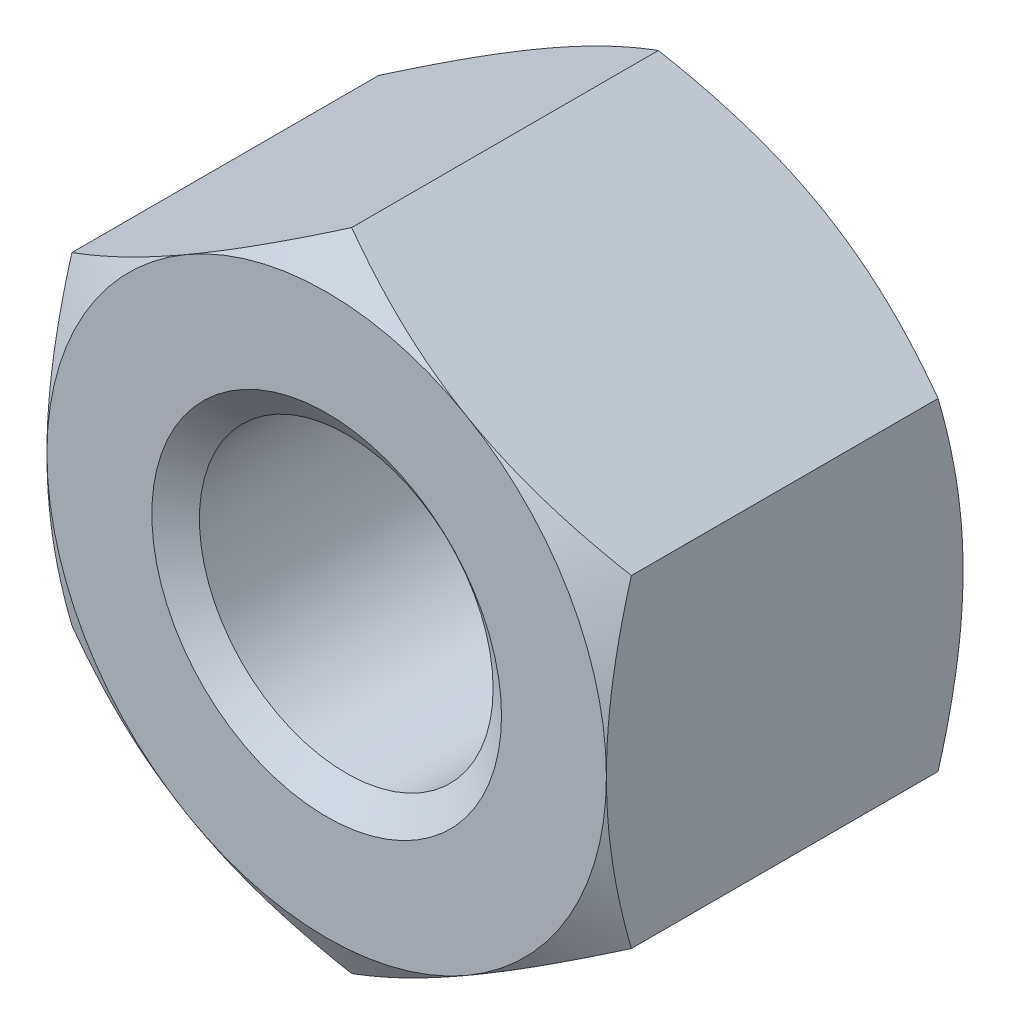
ISO-10303-21;
HEADER;
FILE_DESCRIPTION(('STEP AP214'),'2;1');
FILE_NAME('part.step','',(''),(''),'','','');
FILE_SCHEMA(('AUTOMOTIVE_DESIGN { 1 0 10303 214 1 1 1 1 }'));
ENDSEC;
DATA;
#1=APPLICATION_CONTEXT('core data for automotive mechanical design processes');
#2=APPLICATION_PROTOCOL_DEFINITION('international standard','automotive_design',2000,#1);
#3=PRODUCT_CONTEXT('',#1,'mechanical');
#4=PRODUCT('Part','Part','',(#3));
#5=PRODUCT_RELATED_PRODUCT_CATEGORY('part','',(#4));
#6=PRODUCT_DEFINITION_FORMATION('','',#4);
#7=PRODUCT_DEFINITION_CONTEXT('part definition',#1,'design');
#8=PRODUCT_DEFINITION('design','',#6,#7);
#9=PRODUCT_DEFINITION_SHAPE('','',#8);
#10=(LENGTH_UNIT() NAMED_UNIT(*) SI_UNIT(.MILLI.,.METRE.));
#11=(NAMED_UNIT(*) PLANE_ANGLE_UNIT() SI_UNIT($,.RADIAN.));
#12=(NAMED_UNIT(*) SI_UNIT($,.STERADIAN.) SOLID_ANGLE_UNIT());
#13=UNCERTAINTY_MEASURE_WITH_UNIT(LENGTH_MEASURE(1.E-05),#10,'distance_accuracy_value','');
#14=(GEOMETRIC_REPRESENTATION_CONTEXT(3) GLOBAL_UNCERTAINTY_ASSIGNED_CONTEXT((#13)) GLOBAL_UNIT_ASSIGNED_CONTEXT((#10,
#11,#12)) REPRESENTATION_CONTEXT('',''));
#15=CARTESIAN_POINT('',(0.,0.,0.));
#16=DIRECTION('',(0.,0.,1.));
#17=DIRECTION('',(1.,0.,0.));
#18=AXIS2_PLACEMENT_3D('',#15,#16,#17);
#19=CARTESIAN_POINT('',(0.,0.,-5.1));
#20=DIRECTION('',(0.,0.,1.));
#21=DIRECTION('',(1.,0.,0.));
#22=AXIS2_PLACEMENT_3D('',#19,#20,#21);
#23=CYLINDRICAL_SURFACE('',#22,2.1);
#24=CARTESIAN_POINT('',(0.,0.,-0.28008301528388));
#25=DIRECTION('',(0.,0.,1.));
#26=DIRECTION('',(1.,0.,0.));
#27=AXIS2_PLACEMENT_3D('',#24,#25,#26);
#28=CIRCLE('',#27,2.1);
#29=CARTESIAN_POINT('',(2.1,0.,-0.28008301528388));
#30=VERTEX_POINT('',#29);
#31=EDGE_CURVE('E166',#30,#30,#28,.F.);
#32=ORIENTED_EDGE('',*,*,#31,.F.);
#33=EDGE_LOOP('',(#32));
#34=FACE_BOUND('',#33,.T.);
#35=CARTESIAN_POINT('',(0.,0.,-4.79451698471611));
#36=DIRECTION('',(0.,0.,-1.));
#37=DIRECTION('',(-1.,0.,0.));
#38=AXIS2_PLACEMENT_3D('',#35,#36,#37);
#39=CIRCLE('',#38,2.1);
#40=CARTESIAN_POINT('',(-2.1,0.,-4.79451698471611));
#41=VERTEX_POINT('',#40);
#42=EDGE_CURVE('E31',#41,#41,#39,.F.);
#43=ORIENTED_EDGE('',*,*,#42,.F.);
#44=EDGE_LOOP('',(#43));
#45=FACE_BOUND('',#44,.T.);
#46=ADVANCED_FACE('F26',(#34,#45),#23,.F.);
#47=CARTESIAN_POINT('',(0.,4.61880215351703,-5.1));
#48=DIRECTION('',(0.,0.,-1.));
#49=DIRECTION('',(-1.,0.,0.));
#50=AXIS2_PLACEMENT_3D('',#47,#48,#49);
#51=PLANE('',#50);
#52=CARTESIAN_POINT('',(0.,0.,-5.1));
#53=DIRECTION('',(0.,0.,-1.));
#54=DIRECTION('',(-1.,0.,0.));
#55=AXIS2_PLACEMENT_3D('',#52,#53,#54);
#56=CIRCLE('',#55,4.00000000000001);
#57=CARTESIAN_POINT('',(-4.,0.,-5.1));
#58=VERTEX_POINT('',#57);
#59=CARTESIAN_POINT('',(-2.00000000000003,-3.46410161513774,-5.1));
#60=VERTEX_POINT('',#59);
#61=EDGE_CURVE('E162',#58,#60,#56,.F.);
#62=ORIENTED_EDGE('',*,*,#61,.F.);
#63=CARTESIAN_POINT('',(-2.00000000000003,3.46410161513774,-5.1));
#64=VERTEX_POINT('',#63);
#65=EDGE_CURVE('E144',#64,#58,#56,.F.);
#66=ORIENTED_EDGE('',*,*,#65,.F.);
#67=CARTESIAN_POINT('',(2.00000000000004,3.46410161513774,-5.1));
#68=VERTEX_POINT('',#67);
#69=EDGE_CURVE('E161',#68,#64,#56,.F.);
#70=ORIENTED_EDGE('',*,*,#69,.F.);
#71=CARTESIAN_POINT('',(0.,0.,-5.1));
#72=DIRECTION('',(0.,0.,1.));
#73=DIRECTION('',(1.,0.,0.));
#74=AXIS2_PLACEMENT_3D('',#71,#72,#73);
#75=CIRCLE('',#74,4.);
#76=CARTESIAN_POINT('',(4.,0.,-5.1));
#77=VERTEX_POINT('',#76);
#78=EDGE_CURVE('E236',#77,#68,#75,.T.);
#79=ORIENTED_EDGE('',*,*,#78,.F.);
#80=CARTESIAN_POINT('',(2.00000000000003,-3.46410161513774,-5.1));
#81=VERTEX_POINT('',#80);
#82=EDGE_CURVE('E368',#81,#77,#56,.F.);
#83=ORIENTED_EDGE('',*,*,#82,.F.);
#84=EDGE_CURVE('E389',#60,#81,#56,.F.);
#85=ORIENTED_EDGE('',*,*,#84,.F.);
#86=EDGE_LOOP('',(#62,#66,#70,#79,#83,#85));
#87=FACE_BOUND('',#86,.T.);
#88=CARTESIAN_POINT('',(0.,0.,-5.1));
#89=DIRECTION('',(0.,0.,-1.));
#90=DIRECTION('',(-1.,0.,0.));
#91=AXIS2_PLACEMENT_3D('',#88,#89,#90);
#92=CIRCLE('',#91,2.5);
#93=CARTESIAN_POINT('',(-2.5,0.,-5.1));
#94=VERTEX_POINT('',#93);
#95=EDGE_CURVE('E169',#94,#94,#92,.F.);
#96=ORIENTED_EDGE('',*,*,#95,.T.);
#97=EDGE_LOOP('',(#96));
#98=FACE_BOUND('',#97,.T.);
#99=ADVANCED_FACE('F241',(#87,#98),#51,.T.);
#100=CARTESIAN_POINT('',(0.,4.61880215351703,0.));
#101=DIRECTION('',(0.,0.,-1.));
#102=DIRECTION('',(-1.,0.,0.));
#103=AXIS2_PLACEMENT_3D('',#100,#101,#102);
#104=PLANE('',#103);
#105=CARTESIAN_POINT('',(0.,0.,0.));
#106=DIRECTION('',(0.,0.,-1.));
#107=DIRECTION('',(-1.,0.,0.));
#108=AXIS2_PLACEMENT_3D('',#105,#106,#107);
#109=CIRCLE('',#108,4.);
#110=CARTESIAN_POINT('',(-4.,0.,0.));
#111=VERTEX_POINT('',#110);
#112=CARTESIAN_POINT('',(-2.00000000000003,3.46410161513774,0.));
#113=VERTEX_POINT('',#112);
#114=EDGE_CURVE('E11',#111,#113,#109,.T.);
#115=ORIENTED_EDGE('',*,*,#114,.F.);
#116=CARTESIAN_POINT('',(-2.00000000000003,-3.46410161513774,0.));
#117=VERTEX_POINT('',#116);
#118=EDGE_CURVE('E38',#117,#111,#109,.T.);
#119=ORIENTED_EDGE('',*,*,#118,.F.);
#120=CARTESIAN_POINT('',(2.00000000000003,-3.46410161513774,0.));
#121=VERTEX_POINT('',#120);
#122=EDGE_CURVE('E165',#121,#117,#109,.T.);
#123=ORIENTED_EDGE('',*,*,#122,.F.);
#124=CARTESIAN_POINT('',(4.,0.,0.));
#125=VERTEX_POINT('',#124);
#126=EDGE_CURVE('E334',#125,#121,#109,.T.);
#127=ORIENTED_EDGE('',*,*,#126,.F.);
#128=CARTESIAN_POINT('',(0.,0.,0.));
#129=DIRECTION('',(0.,0.,1.));
#130=DIRECTION('',(1.,0.,0.));
#131=AXIS2_PLACEMENT_3D('',#128,#129,#130);
#132=CIRCLE('',#131,4.);
#133=CARTESIAN_POINT('',(2.00000000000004,3.46410161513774,0.));
#134=VERTEX_POINT('',#133);
#135=EDGE_CURVE('E120',#125,#134,#132,.T.);
#136=ORIENTED_EDGE('',*,*,#135,.T.);
#137=EDGE_CURVE('E36',#113,#134,#109,.T.);
#138=ORIENTED_EDGE('',*,*,#137,.F.);
#139=EDGE_LOOP('',(#115,#119,#123,#127,#136,#138));
#140=FACE_BOUND('',#139,.T.);
#141=CARTESIAN_POINT('',(0.,0.,0.));
#142=DIRECTION('',(0.,0.,1.));
#143=DIRECTION('',(1.,0.,0.));
#144=AXIS2_PLACEMENT_3D('',#141,#142,#143);
#145=CIRCLE('',#144,2.5);
#146=CARTESIAN_POINT('',(2.5,0.,0.));
#147=VERTEX_POINT('',#146);
#148=EDGE_CURVE('E168',#147,#147,#145,.T.);
#149=ORIENTED_EDGE('',*,*,#148,.F.);
#150=EDGE_LOOP('',(#149));
#151=FACE_BOUND('',#150,.T.);
#152=ADVANCED_FACE('F294',(#140,#151),#104,.F.);
#153=CARTESIAN_POINT('',(0.,4.61880215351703,-5.1));
#154=DIRECTION('',(-0.500000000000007,0.866025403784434,0.));
#155=DIRECTION('',(-0.866025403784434,-0.500000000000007,0.));
#156=AXIS2_PLACEMENT_3D('',#153,#154,#155);
#157=PLANE('',#156);
#158=DIRECTION('',(0.,0.,1.));
#159=VECTOR('',#158,1.);
#160=CARTESIAN_POINT('',(-4.,2.30940107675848,-5.1));
#161=LINE('',#160,#159);
#162=CARTESIAN_POINT('',(-4.,2.30940107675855,-4.74273441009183));
#163=VERTEX_POINT('',#162);
#164=CARTESIAN_POINT('',(-4.,2.30940107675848,-0.357265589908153));
#165=VERTEX_POINT('',#164);
#166=EDGE_CURVE('E156',#163,#165,#161,.T.);
#167=ORIENTED_EDGE('',*,*,#166,.T.);
#168=CARTESIAN_POINT('',(-4.0002,2.30928560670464,-0.357332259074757));
#169=CARTESIAN_POINT('',(-3.82442084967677,2.41077174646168,-0.298717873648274));
#170=CARTESIAN_POINT('',(-3.64712438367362,2.51313390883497,-0.245410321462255));
#171=CARTESIAN_POINT('',(-3.2894614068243,2.7196307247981,-0.152361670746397));
#172=CARTESIAN_POINT('',(-3.10908854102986,2.82376904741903,-0.112653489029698));
#173=CARTESIAN_POINT('',(-2.75057818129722,3.03075510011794,-0.050842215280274));
#174=CARTESIAN_POINT('',(-2.57249584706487,3.1335709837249,-0.0283277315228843));
#175=CARTESIAN_POINT('',(-2.2154932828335,3.33968651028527,-0.00145062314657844));
#176=CARTESIAN_POINT('',(-2.03657435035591,3.44298540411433,0.00293425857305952));
#177=CARTESIAN_POINT('',(-1.70225715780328,3.63600352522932,-0.00619007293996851));
#178=CARTESIAN_POINT('',(-1.54680884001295,3.72575165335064,-0.0174589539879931));
#179=CARTESIAN_POINT('',(-1.23692494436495,3.90466320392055,-0.0531739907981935));
#180=CARTESIAN_POINT('',(-1.08249043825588,3.99382600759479,-0.0776323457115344));
#181=CARTESIAN_POINT('',(-0.771967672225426,4.17310641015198,-0.138776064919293));
#182=CARTESIAN_POINT('',(-0.6159187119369,4.26320131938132,-0.175720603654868));
#183=CARTESIAN_POINT('',(-0.30614816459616,4.44204742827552,-0.259570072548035));
#184=CARTESIAN_POINT('',(-0.152422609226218,4.53080091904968,-0.306455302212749));
#185=CARTESIAN_POINT('',(0.000200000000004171,4.61891762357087,-0.357332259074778));
#186=B_SPLINE_CURVE_WITH_KNOTS('',3,(#168,#169,#170,#171,#172,#173,#174,#175,#176,#177,#178,
#179,#180,#181,#182,#183,#184,#185),.UNSPECIFIED.,.F.,.F.,(4,2,2,2,2,2,2,2,4),(0.,
0.634047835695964,1.26961969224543,1.88946157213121,2.50854226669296,3.04757825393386,
3.58711366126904,4.13861653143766,4.68903648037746),.UNSPECIFIED.);
#187=EDGE_CURVE('E125',#165,#113,#186,.T.);
#188=ORIENTED_EDGE('',*,*,#187,.T.);
#189=CARTESIAN_POINT('',(0.,4.61880215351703,-0.357265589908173));
#190=VERTEX_POINT('',#189);
#191=EDGE_CURVE('E45',#113,#190,#186,.T.);
#192=ORIENTED_EDGE('',*,*,#191,.T.);
#193=DIRECTION('',(0.,0.,1.));
#194=VECTOR('',#193,1.);
#195=CARTESIAN_POINT('',(0.,4.61880215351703,-5.1));
#196=LINE('',#195,#194);
#197=CARTESIAN_POINT('',(0.,4.61880215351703,-4.74273441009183));
#198=VERTEX_POINT('',#197);
#199=EDGE_CURVE('E141',#198,#190,#196,.T.);
#200=ORIENTED_EDGE('',*,*,#199,.F.);
#201=CARTESIAN_POINT('',(-4.0002,2.30928560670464,-4.74266774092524));
#202=CARTESIAN_POINT('',(-3.82442084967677,2.41077174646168,-4.80128212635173));
#203=CARTESIAN_POINT('',(-3.64712438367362,2.51313390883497,-4.85458967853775));
#204=CARTESIAN_POINT('',(-3.2894614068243,2.7196307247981,-4.9476383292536));
#205=CARTESIAN_POINT('',(-3.10908854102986,2.82376904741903,-4.9873465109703));
#206=CARTESIAN_POINT('',(-2.75057818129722,3.03075510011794,-5.04915778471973));
#207=CARTESIAN_POINT('',(-2.57249584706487,3.1335709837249,-5.07167226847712));
#208=CARTESIAN_POINT('',(-2.2154932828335,3.33968651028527,-5.09854937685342));
#209=CARTESIAN_POINT('',(-2.03657435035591,3.44298540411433,-5.10293425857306));
#210=CARTESIAN_POINT('',(-1.70225715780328,3.63600352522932,-5.09380992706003));
#211=CARTESIAN_POINT('',(-1.54680884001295,3.72575165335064,-5.08254104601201));
#212=CARTESIAN_POINT('',(-1.23692494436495,3.90466320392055,-5.04682600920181));
#213=CARTESIAN_POINT('',(-1.08249043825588,3.99382600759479,-5.02236765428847));
#214=CARTESIAN_POINT('',(-0.771967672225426,4.17310641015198,-4.96122393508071));
#215=CARTESIAN_POINT('',(-0.6159187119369,4.26320131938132,-4.92427939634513));
#216=CARTESIAN_POINT('',(-0.30614816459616,4.44204742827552,-4.84042992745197));
#217=CARTESIAN_POINT('',(-0.152422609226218,4.53080091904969,-4.79354469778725));
#218=CARTESIAN_POINT('',(0.000200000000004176,4.61891762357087,-4.74266774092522));
#219=B_SPLINE_CURVE_WITH_KNOTS('',3,(#201,#202,#203,#204,#205,#206,#207,#208,#209,#210,#211,
#212,#213,#214,#215,#216,#217,#218),.UNSPECIFIED.,.F.,.F.,(4,2,2,2,2,2,2,2,4),(0.,
0.634047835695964,1.26961969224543,1.88946157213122,2.50854226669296,3.04757825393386,
3.58711366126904,4.13861653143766,4.68903648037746),.UNSPECIFIED.);
#220=EDGE_CURVE('E159',#64,#198,#219,.T.);
#221=ORIENTED_EDGE('',*,*,#220,.F.);
#222=EDGE_CURVE('E251',#163,#64,#219,.T.);
#223=ORIENTED_EDGE('',*,*,#222,.F.);
#224=EDGE_LOOP('',(#167,#188,#192,#200,#221,#223));
#225=FACE_BOUND('',#224,.T.);
#226=ADVANCED_FACE('F28',(#225),#157,.T.);
#227=CARTESIAN_POINT('',(4.,2.30940107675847,-5.1));
#228=DIRECTION('',(0.500000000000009,0.866025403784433,0.));
#229=DIRECTION('',(-0.866025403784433,0.500000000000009,0.));
#230=AXIS2_PLACEMENT_3D('',#227,#228,#229);
#231=PLANE('',#230);
#232=ORIENTED_EDGE('',*,*,#199,.T.);
#233=CARTESIAN_POINT('',(-0.000199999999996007,4.61891762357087,-0.357332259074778));
#234=CARTESIAN_POINT('',(0.175579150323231,4.51743148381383,-0.298717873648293));
#235=CARTESIAN_POINT('',(0.352875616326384,4.41506932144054,-0.245410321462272));
#236=CARTESIAN_POINT('',(0.710538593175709,4.20857250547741,-0.15236167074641));
#237=CARTESIAN_POINT('',(0.890911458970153,4.10443418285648,-0.112653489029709));
#238=CARTESIAN_POINT('',(1.24942181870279,3.89744813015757,-0.0508422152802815));
#239=CARTESIAN_POINT('',(1.42750415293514,3.7946322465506,-0.02832773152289));
#240=CARTESIAN_POINT('',(1.78450671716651,3.58851671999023,-0.0014506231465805));
#241=CARTESIAN_POINT('',(1.9634256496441,3.48521782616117,0.00293425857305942));
#242=CARTESIAN_POINT('',(2.29774284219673,3.29219970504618,-0.00619007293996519));
#243=CARTESIAN_POINT('',(2.45319115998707,3.20245157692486,-0.0174589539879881));
#244=CARTESIAN_POINT('',(2.76307505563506,3.02354002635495,-0.0531739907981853));
#245=CARTESIAN_POINT('',(2.91750956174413,2.93437722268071,-0.0776323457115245));
#246=CARTESIAN_POINT('',(3.22803232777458,2.75509682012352,-0.13877606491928));
#247=CARTESIAN_POINT('',(3.3840812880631,2.66500191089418,-0.175720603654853));
#248=CARTESIAN_POINT('',(3.69385183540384,2.48615580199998,-0.259570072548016));
#249=CARTESIAN_POINT('',(3.84757739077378,2.39740231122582,-0.306455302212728));
#250=CARTESIAN_POINT('',(4.0002,2.30928560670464,-0.357332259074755));
#251=B_SPLINE_CURVE_WITH_KNOTS('',3,(#233,#234,#235,#236,#237,#238,#239,#240,#241,#242,#243,
#244,#245,#246,#247,#248,#249,#250),.UNSPECIFIED.,.F.,.F.,(4,2,2,2,2,2,2,2,4),(0.,
0.634047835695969,1.26961969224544,1.88946157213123,2.50854226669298,3.04757825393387,
3.58711366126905,4.13861653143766,4.68903648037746),.UNSPECIFIED.);
#252=EDGE_CURVE('E135',#190,#134,#251,.T.);
#253=ORIENTED_EDGE('',*,*,#252,.T.);
#254=CARTESIAN_POINT('',(4.,2.30940107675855,-0.357265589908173));
#255=VERTEX_POINT('',#254);
#256=EDGE_CURVE('E52',#134,#255,#251,.T.);
#257=ORIENTED_EDGE('',*,*,#256,.T.);
#258=DIRECTION('',(0.,0.,1.));
#259=VECTOR('',#258,1.);
#260=CARTESIAN_POINT('',(4.,2.30940107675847,-5.1));
#261=LINE('',#260,#259);
#262=CARTESIAN_POINT('',(4.,2.30940107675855,-4.74273441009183));
#263=VERTEX_POINT('',#262);
#264=EDGE_CURVE('E134',#263,#255,#261,.T.);
#265=ORIENTED_EDGE('',*,*,#264,.F.);
#266=CARTESIAN_POINT('',(-0.000199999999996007,4.61891762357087,-4.74266774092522));
#267=CARTESIAN_POINT('',(0.175579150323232,4.51743148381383,-4.80128212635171));
#268=CARTESIAN_POINT('',(0.352875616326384,4.41506932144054,-4.85458967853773));
#269=CARTESIAN_POINT('',(0.710538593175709,4.20857250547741,-4.94763832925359));
#270=CARTESIAN_POINT('',(0.890911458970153,4.10443418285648,-4.98734651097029));
#271=CARTESIAN_POINT('',(1.24942181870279,3.89744813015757,-5.04915778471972));
#272=CARTESIAN_POINT('',(1.42750415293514,3.7946322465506,-5.07167226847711));
#273=CARTESIAN_POINT('',(1.78450671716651,3.58851671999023,-5.09854937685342));
#274=CARTESIAN_POINT('',(1.9634256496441,3.48521782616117,-5.10293425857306));
#275=CARTESIAN_POINT('',(2.29774284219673,3.29219970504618,-5.09380992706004));
#276=CARTESIAN_POINT('',(2.45319115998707,3.20245157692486,-5.08254104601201));
#277=CARTESIAN_POINT('',(2.76307505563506,3.02354002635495,-5.04682600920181));
#278=CARTESIAN_POINT('',(2.91750956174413,2.93437722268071,-5.02236765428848));
#279=CARTESIAN_POINT('',(3.22803232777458,2.75509682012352,-4.96122393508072));
#280=CARTESIAN_POINT('',(3.3840812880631,2.66500191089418,-4.92427939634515));
#281=CARTESIAN_POINT('',(3.69385183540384,2.48615580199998,-4.84042992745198));
#282=CARTESIAN_POINT('',(3.84757739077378,2.39740231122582,-4.79354469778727));
#283=CARTESIAN_POINT('',(4.0002,2.30928560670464,-4.74266774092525));
#284=B_SPLINE_CURVE_WITH_KNOTS('',3,(#266,#267,#268,#269,#270,#271,#272,#273,#274,#275,#276,
#277,#278,#279,#280,#281,#282,#283),.UNSPECIFIED.,.F.,.F.,(4,2,2,2,2,2,2,2,4),(0.,
0.634047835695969,1.26961969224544,1.88946157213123,2.50854226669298,3.04757825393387,
3.58711366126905,4.13861653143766,4.68903648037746),.UNSPECIFIED.);
#285=EDGE_CURVE('E245',#68,#263,#284,.T.);
#286=ORIENTED_EDGE('',*,*,#285,.F.);
#287=EDGE_CURVE('E250',#198,#68,#284,.T.);
#288=ORIENTED_EDGE('',*,*,#287,.F.);
#289=EDGE_LOOP('',(#232,#253,#257,#265,#286,#288));
#290=FACE_BOUND('',#289,.T.);
#291=ADVANCED_FACE('F132',(#290),#231,.T.);
#292=CARTESIAN_POINT('',(4.,2.30940107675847,-5.1));
#293=DIRECTION('',(-1.,0.,0.));
#294=DIRECTION('',(0.,0.,1.));
#295=AXIS2_PLACEMENT_3D('',#292,#293,#294);
#296=PLANE('',#295);
#297=CARTESIAN_POINT('',(4.,-6.12487198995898,-1.91410682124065));
#298=CARTESIAN_POINT('',(4.,-5.94924937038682,-1.82923627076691));
#299=CARTESIAN_POINT('',(4.,-5.77321152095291,-1.74520940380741));
#300=CARTESIAN_POINT('',(4.,-5.4200808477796,-1.57932514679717));
#301=CARTESIAN_POINT('',(4.,-5.24298784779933,-1.49746813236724));
#302=CARTESIAN_POINT('',(4.,-4.88656571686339,-1.33597446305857));
#303=CARTESIAN_POINT('',(4.,-4.70722958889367,-1.25635319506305));
#304=CARTESIAN_POINT('',(4.,-4.34708334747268,-1.10053058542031));
#305=CARTESIAN_POINT('',(4.,-4.16627331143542,-1.02432906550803));
#306=CARTESIAN_POINT('',(4.,-3.80064706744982,-0.875350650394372));
#307=CARTESIAN_POINT('',(4.,-3.61580892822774,-0.802627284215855));
#308=CARTESIAN_POINT('',(4.,-3.24395246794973,-0.662876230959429));
#309=CARTESIAN_POINT('',(4.,-3.05693390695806,-0.595849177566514));
#310=CARTESIAN_POINT('',(4.,-2.68080318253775,-0.46929174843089));
#311=CARTESIAN_POINT('',(4.,-2.49169643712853,-0.409745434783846));
#312=CARTESIAN_POINT('',(4.,-2.11079454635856,-0.300083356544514));
#313=CARTESIAN_POINT('',(4.,-1.91900027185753,-0.249964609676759));
#314=CARTESIAN_POINT('',(4.,-1.53259232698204,-0.161590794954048));
#315=CARTESIAN_POINT('',(4.,-1.33797792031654,-0.123338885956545));
#316=CARTESIAN_POINT('',(4.,-0.946402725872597,-0.0612742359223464));
#317=CARTESIAN_POINT('',(4.,-0.749441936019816,-0.0374615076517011));
#318=CARTESIAN_POINT('',(4.,-0.355451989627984,-0.00638181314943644));
#319=CARTESIAN_POINT('',(4.,-0.158431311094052,0.000989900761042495));
#320=CARTESIAN_POINT('',(4.,0.235472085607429,-0.00120406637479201));
#321=CARTESIAN_POINT('',(4.,0.432354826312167,-0.010765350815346));
#322=CARTESIAN_POINT('',(4.,0.768560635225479,-0.0408787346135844));
#323=CARTESIAN_POINT('',(4.,0.908254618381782,-0.0575092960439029));
#324=CARTESIAN_POINT('',(4.,1.18656349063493,-0.0982134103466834));
#325=CARTESIAN_POINT('',(4.,1.32517820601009,-0.122288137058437));
#326=CARTESIAN_POINT('',(4.,1.73929045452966,-0.204415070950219));
#327=CARTESIAN_POINT('',(4.,2.01284690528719,-0.27234888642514));
#328=CARTESIAN_POINT('',(4.,2.4221825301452,-0.389516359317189));
#329=CARTESIAN_POINT('',(4.,2.56009536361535,-0.431713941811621));
#330=CARTESIAN_POINT('',(4.,2.834481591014,-0.520284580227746));
#331=CARTESIAN_POINT('',(4.,2.97095590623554,-0.566654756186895));
#332=CARTESIAN_POINT('',(4.,3.24189440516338,-0.662605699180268));
#333=CARTESIAN_POINT('',(4.,3.37636557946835,-0.712166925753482));
#334=CARTESIAN_POINT('',(4.,3.64426461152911,-0.814198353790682));
#335=CARTESIAN_POINT('',(4.,3.77769202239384,-0.866669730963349));
#336=CARTESIAN_POINT('',(4.,3.91063698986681,-0.920309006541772));
#337=B_SPLINE_CURVE_WITH_KNOTS('',3,(#297,#298,#299,#300,#301,#302,#303,#304,#305,#306,#307,
#308,#309,#310,#311,#312,#313,#314,#315,#316,#317,#318,#319,#320,#321,#322,#323,#324,#325,#326,
#327,#328,#329,#330,#331,#332,#333,#334,#335,#336),.UNSPECIFIED.,.F.,.F.,(4,2,2,2,2,2,2,2,2,2,2,
2,2,2,2,2,2,2,2,4),(0.,0.585171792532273,1.17044423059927,1.7590659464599,2.34765694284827,
2.94347400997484,3.5393572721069,4.13394864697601,4.72835161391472,5.32291267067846,
5.91747425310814,6.50823685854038,7.09884609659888,7.52068140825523,7.94258327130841,
8.78701491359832,9.21965281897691,9.651994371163,10.0819024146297,10.5119854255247),.UNSPECIFIED.);
#338=CARTESIAN_POINT('',(4.,-2.30940107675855,-0.357265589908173));
#339=VERTEX_POINT('',#338);
#340=EDGE_CURVE('E127',#339,#125,#337,.T.);
#341=ORIENTED_EDGE('',*,*,#340,.F.);
#342=DIRECTION('',(0.,0.,1.));
#343=VECTOR('',#342,1.);
#344=CARTESIAN_POINT('',(4.,-2.30940107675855,-5.1));
#345=LINE('',#344,#343);
#346=CARTESIAN_POINT('',(4.,-2.30940107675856,-4.74273441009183));
#347=VERTEX_POINT('',#346);
#348=EDGE_CURVE('E142',#347,#339,#345,.T.);
#349=ORIENTED_EDGE('',*,*,#348,.F.);
#350=CARTESIAN_POINT('',(4.,-6.12487198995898,-3.18589317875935));
#351=CARTESIAN_POINT('',(4.,-5.94924937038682,-3.27076372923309));
#352=CARTESIAN_POINT('',(4.,-5.77321152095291,-3.35479059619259));
#353=CARTESIAN_POINT('',(4.,-5.4200808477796,-3.52067485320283));
#354=CARTESIAN_POINT('',(4.,-5.24298784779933,-3.60253186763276));
#355=CARTESIAN_POINT('',(4.,-4.88656571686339,-3.76402553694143));
#356=CARTESIAN_POINT('',(4.,-4.70722958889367,-3.84364680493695));
#357=CARTESIAN_POINT('',(4.,-4.34708334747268,-3.99946941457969));
#358=CARTESIAN_POINT('',(4.,-4.16627331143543,-4.07567093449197));
#359=CARTESIAN_POINT('',(4.,-3.80064706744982,-4.22464934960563));
#360=CARTESIAN_POINT('',(4.,-3.61580892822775,-4.29737271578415));
#361=CARTESIAN_POINT('',(4.,-3.24395246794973,-4.43712376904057));
#362=CARTESIAN_POINT('',(4.,-3.05693390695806,-4.50415082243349));
#363=CARTESIAN_POINT('',(4.,-2.68080318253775,-4.63070825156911));
#364=CARTESIAN_POINT('',(4.,-2.49169643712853,-4.69025456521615));
#365=CARTESIAN_POINT('',(4.,-2.11079454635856,-4.79991664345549));
#366=CARTESIAN_POINT('',(4.,-1.91900027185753,-4.85003539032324));
#367=CARTESIAN_POINT('',(4.,-1.53259232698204,-4.93840920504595));
#368=CARTESIAN_POINT('',(4.,-1.33797792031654,-4.97666111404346));
#369=CARTESIAN_POINT('',(4.,-0.946402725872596,-5.03872576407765));
#370=CARTESIAN_POINT('',(4.,-0.749441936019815,-5.0625384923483));
#371=CARTESIAN_POINT('',(4.,-0.355451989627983,-5.09361818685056));
#372=CARTESIAN_POINT('',(4.,-0.158431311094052,-5.10098990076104));
#373=CARTESIAN_POINT('',(4.,0.235472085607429,-5.09879593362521));
#374=CARTESIAN_POINT('',(4.,0.432354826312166,-5.08923464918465));
#375=CARTESIAN_POINT('',(4.,0.768560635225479,-5.05912126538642));
#376=CARTESIAN_POINT('',(4.,0.908254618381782,-5.0424907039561));
#377=CARTESIAN_POINT('',(4.,1.18656349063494,-5.00178658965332));
#378=CARTESIAN_POINT('',(4.,1.3251782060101,-4.97771186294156));
#379=CARTESIAN_POINT('',(4.,1.73929045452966,-4.89558492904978));
#380=CARTESIAN_POINT('',(4.,2.01284690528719,-4.82765111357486));
#381=CARTESIAN_POINT('',(4.,2.4221825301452,-4.71048364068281));
#382=CARTESIAN_POINT('',(4.,2.56009536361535,-4.66828605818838));
#383=CARTESIAN_POINT('',(4.,2.83448159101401,-4.57971541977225));
#384=CARTESIAN_POINT('',(4.,2.97095590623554,-4.5333452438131));
#385=CARTESIAN_POINT('',(4.,3.24189440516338,-4.43739430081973));
#386=CARTESIAN_POINT('',(4.,3.37636557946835,-4.38783307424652));
#387=CARTESIAN_POINT('',(4.,3.64426461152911,-4.28580164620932));
#388=CARTESIAN_POINT('',(4.,3.77769202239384,-4.23333026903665));
#389=CARTESIAN_POINT('',(4.,3.91063698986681,-4.17969099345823));
#390=B_SPLINE_CURVE_WITH_KNOTS('',3,(#350,#351,#352,#353,#354,#355,#356,#357,#358,#359,#360,
#361,#362,#363,#364,#365,#366,#367,#368,#369,#370,#371,#372,#373,#374,#375,#376,#377,#378,#379,
#380,#381,#382,#383,#384,#385,#386,#387,#388,#389),.UNSPECIFIED.,.F.,.F.,(4,2,2,2,2,2,2,2,2,2,2,
2,2,2,2,2,2,2,2,4),(0.,0.585171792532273,1.17044423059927,1.7590659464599,2.34765694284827,
2.94347400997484,3.5393572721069,4.13394864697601,4.72835161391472,5.32291267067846,
5.91747425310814,6.50823685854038,7.09884609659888,7.52068140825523,7.94258327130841,
8.78701491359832,9.21965281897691,9.651994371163,10.0819024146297,10.5119854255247),.UNSPECIFIED.);
#391=EDGE_CURVE('E257',#347,#77,#390,.T.);
#392=ORIENTED_EDGE('',*,*,#391,.T.);
#393=EDGE_CURVE('E140',#77,#263,#390,.T.);
#394=ORIENTED_EDGE('',*,*,#393,.T.);
#395=ORIENTED_EDGE('',*,*,#264,.T.);
#396=EDGE_CURVE('E117',#125,#255,#337,.T.);
#397=ORIENTED_EDGE('',*,*,#396,.F.);
#398=EDGE_LOOP('',(#341,#349,#392,#394,#395,#397));
#399=FACE_BOUND('',#398,.T.);
#400=ADVANCED_FACE('F138',(#399),#296,.F.);
#401=CARTESIAN_POINT('',(0.,-4.6188021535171,-5.1));
#402=DIRECTION('',(0.500000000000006,-0.866025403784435,0.));
#403=DIRECTION('',(0.866025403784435,0.500000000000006,0.));
#404=AXIS2_PLACEMENT_3D('',#401,#402,#403);
#405=PLANE('',#404);
#406=ORIENTED_EDGE('',*,*,#348,.T.);
#407=CARTESIAN_POINT('',(4.0002,-2.30928560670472,-0.357332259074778));
#408=CARTESIAN_POINT('',(3.82442084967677,-2.41077174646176,-0.298717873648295));
#409=CARTESIAN_POINT('',(3.64712438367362,-2.51313390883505,-0.245410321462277));
#410=CARTESIAN_POINT('',(3.28946140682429,-2.71963072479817,-0.152361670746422));
#411=CARTESIAN_POINT('',(3.10908854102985,-2.8237690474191,-0.112653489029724));
#412=CARTESIAN_POINT('',(2.75057818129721,-3.03075510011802,-0.0508422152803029));
#413=CARTESIAN_POINT('',(2.57249584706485,-3.13357098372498,-0.0283277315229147));
#414=CARTESIAN_POINT('',(2.21549328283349,-3.33968651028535,-0.00145062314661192));
#415=CARTESIAN_POINT('',(2.03657435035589,-3.44298540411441,0.00293425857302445));
#416=CARTESIAN_POINT('',(1.70225715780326,-3.6360035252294,-0.00619007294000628));
#417=CARTESIAN_POINT('',(1.54680884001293,-3.72575165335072,-0.0174589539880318));
#418=CARTESIAN_POINT('',(1.23692494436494,-3.90466320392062,-0.0531739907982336));
#419=CARTESIAN_POINT('',(1.08249043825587,-3.99382600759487,-0.077632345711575));
#420=CARTESIAN_POINT('',(0.771967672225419,-4.17310641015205,-0.138776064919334));
#421=CARTESIAN_POINT('',(0.615918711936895,-4.2632013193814,-0.175720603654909));
#422=CARTESIAN_POINT('',(0.306148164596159,-4.44204742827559,-0.259570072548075));
#423=CARTESIAN_POINT('',(0.152422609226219,-4.53080091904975,-0.306455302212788));
#424=CARTESIAN_POINT('',(-0.000200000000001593,-4.61891762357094,-0.357332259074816));
#425=B_SPLINE_CURVE_WITH_KNOTS('',3,(#407,#408,#409,#410,#411,#412,#413,#414,#415,#416,#417,
#418,#419,#420,#421,#422,#423,#424),.UNSPECIFIED.,.F.,.F.,(4,2,2,2,2,2,2,2,4),(0.,
0.634047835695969,1.26961969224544,1.88946157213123,2.50854226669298,3.04757825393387,
3.58711366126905,4.13861653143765,4.68903648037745),.UNSPECIFIED.);
#426=EDGE_CURVE('E337',#339,#121,#425,.T.);
#427=ORIENTED_EDGE('',*,*,#426,.T.);
#428=CARTESIAN_POINT('',(-1.15792792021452E-13,-4.61880215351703,-0.357265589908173));
#429=VERTEX_POINT('',#428);
#430=EDGE_CURVE('E217',#121,#429,#425,.T.);
#431=ORIENTED_EDGE('',*,*,#430,.T.);
#432=DIRECTION('',(0.,0.,1.));
#433=VECTOR('',#432,1.);
#434=CARTESIAN_POINT('',(0.,-4.6188021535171,-5.1));
#435=LINE('',#434,#433);
#436=CARTESIAN_POINT('',(-1.15792792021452E-13,-4.61880215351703,-4.74273441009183));
#437=VERTEX_POINT('',#436);
#438=EDGE_CURVE('E147',#437,#429,#435,.T.);
#439=ORIENTED_EDGE('',*,*,#438,.F.);
#440=CARTESIAN_POINT('',(4.0002,-2.30928560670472,-4.74266774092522));
#441=CARTESIAN_POINT('',(3.82442084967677,-2.41077174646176,-4.80128212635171));
#442=CARTESIAN_POINT('',(3.64712438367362,-2.51313390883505,-4.85458967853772));
#443=CARTESIAN_POINT('',(3.28946140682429,-2.71963072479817,-4.94763832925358));
#444=CARTESIAN_POINT('',(3.10908854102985,-2.8237690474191,-4.98734651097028));
#445=CARTESIAN_POINT('',(2.75057818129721,-3.03075510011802,-5.0491577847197));
#446=CARTESIAN_POINT('',(2.57249584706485,-3.13357098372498,-5.07167226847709));
#447=CARTESIAN_POINT('',(2.21549328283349,-3.33968651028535,-5.09854937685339));
#448=CARTESIAN_POINT('',(2.03657435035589,-3.44298540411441,-5.10293425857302));
#449=CARTESIAN_POINT('',(1.70225715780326,-3.6360035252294,-5.09380992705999));
#450=CARTESIAN_POINT('',(1.54680884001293,-3.72575165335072,-5.08254104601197));
#451=CARTESIAN_POINT('',(1.23692494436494,-3.90466320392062,-5.04682600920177));
#452=CARTESIAN_POINT('',(1.08249043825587,-3.99382600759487,-5.02236765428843));
#453=CARTESIAN_POINT('',(0.771967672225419,-4.17310641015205,-4.96122393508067));
#454=CARTESIAN_POINT('',(0.615918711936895,-4.2632013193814,-4.92427939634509));
#455=CARTESIAN_POINT('',(0.306148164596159,-4.44204742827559,-4.84042992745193));
#456=CARTESIAN_POINT('',(0.152422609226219,-4.53080091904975,-4.79354469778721));
#457=CARTESIAN_POINT('',(-0.00020000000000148,-4.61891762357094,-4.74266774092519));
#458=B_SPLINE_CURVE_WITH_KNOTS('',3,(#440,#441,#442,#443,#444,#445,#446,#447,#448,#449,#450,
#451,#452,#453,#454,#455,#456,#457),.UNSPECIFIED.,.F.,.F.,(4,2,2,2,2,2,2,2,4),(0.,
0.634047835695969,1.26961969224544,1.88946157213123,2.50854226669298,3.04757825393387,
3.58711366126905,4.13861653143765,4.68903648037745),.UNSPECIFIED.);
#459=EDGE_CURVE('E263',#81,#437,#458,.T.);
#460=ORIENTED_EDGE('',*,*,#459,.F.);
#461=EDGE_CURVE('E262',#347,#81,#458,.T.);
#462=ORIENTED_EDGE('',*,*,#461,.F.);
#463=EDGE_LOOP('',(#406,#427,#431,#439,#460,#462));
#464=FACE_BOUND('',#463,.T.);
#465=ADVANCED_FACE('F273',(#464),#405,.T.);
#466=CARTESIAN_POINT('',(-4.,-2.30940107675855,-5.1));
#467=DIRECTION('',(-0.500000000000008,-0.866025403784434,0.));
#468=DIRECTION('',(0.866025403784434,-0.500000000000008,0.));
#469=AXIS2_PLACEMENT_3D('',#466,#467,#468);
#470=PLANE('',#469);
#471=ORIENTED_EDGE('',*,*,#438,.T.);
#472=CARTESIAN_POINT('',(0.000199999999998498,-4.61891762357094,-0.357332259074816));
#473=CARTESIAN_POINT('',(-0.175579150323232,-4.51743148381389,-0.29871787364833));
#474=CARTESIAN_POINT('',(-0.352875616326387,-4.4150693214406,-0.245410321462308));
#475=CARTESIAN_POINT('',(-0.710538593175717,-4.20857250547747,-0.152361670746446));
#476=CARTESIAN_POINT('',(-0.890911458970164,-4.10443418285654,-0.112653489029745));
#477=CARTESIAN_POINT('',(-1.24942181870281,-3.89744813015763,-0.0508422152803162));
#478=CARTESIAN_POINT('',(-1.42750415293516,-3.79463224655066,-0.0283277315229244));
#479=CARTESIAN_POINT('',(-1.78450671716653,-3.58851671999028,-0.0014506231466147));
#480=CARTESIAN_POINT('',(-1.96342564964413,-3.48521782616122,0.00293425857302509));
#481=CARTESIAN_POINT('',(-2.29774284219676,-3.29219970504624,-0.00619007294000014));
#482=CARTESIAN_POINT('',(-2.45319115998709,-3.20245157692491,-0.017458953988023));
#483=CARTESIAN_POINT('',(-2.76307505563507,-3.02354002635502,-0.0531739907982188));
#484=CARTESIAN_POINT('',(-2.91750956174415,-2.93437722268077,-0.0776323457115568));
#485=CARTESIAN_POINT('',(-3.22803232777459,-2.75509682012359,-0.138776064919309));
#486=CARTESIAN_POINT('',(-3.38408128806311,-2.66500191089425,-0.175720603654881));
#487=CARTESIAN_POINT('',(-3.69385183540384,-2.48615580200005,-0.259570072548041));
#488=CARTESIAN_POINT('',(-3.84757739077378,-2.39740231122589,-0.306455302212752));
#489=CARTESIAN_POINT('',(-4.0002,-2.30928560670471,-0.357332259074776));
#490=B_SPLINE_CURVE_WITH_KNOTS('',3,(#472,#473,#474,#475,#476,#477,#478,#479,#480,#481,#482,
#483,#484,#485,#486,#487,#488,#489),.UNSPECIFIED.,.F.,.F.,(4,2,2,2,2,2,2,2,4),(0.,
0.634047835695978,1.26961969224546,1.88946157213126,2.50854226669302,3.0475782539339,
3.58711366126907,4.13861653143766,4.68903648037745),.UNSPECIFIED.);
#491=EDGE_CURVE('E340',#429,#117,#490,.T.);
#492=ORIENTED_EDGE('',*,*,#491,.T.);
#493=CARTESIAN_POINT('',(-4.,-2.30940107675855,-0.357265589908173));
#494=VERTEX_POINT('',#493);
#495=EDGE_CURVE('E191',#117,#494,#490,.T.);
#496=ORIENTED_EDGE('',*,*,#495,.T.);
#497=DIRECTION('',(0.,0.,1.));
#498=VECTOR('',#497,1.);
#499=CARTESIAN_POINT('',(-4.,-2.30940107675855,-5.1));
#500=LINE('',#499,#498);
#501=CARTESIAN_POINT('',(-4.,-2.30940107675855,-4.74273441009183));
#502=VERTEX_POINT('',#501);
#503=EDGE_CURVE('E153',#502,#494,#500,.T.);
#504=ORIENTED_EDGE('',*,*,#503,.F.);
#505=CARTESIAN_POINT('',(0.000199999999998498,-4.61891762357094,-4.74266774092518));
#506=CARTESIAN_POINT('',(-0.175579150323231,-4.51743148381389,-4.80128212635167));
#507=CARTESIAN_POINT('',(-0.352875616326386,-4.4150693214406,-4.85458967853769));
#508=CARTESIAN_POINT('',(-0.710538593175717,-4.20857250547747,-4.94763832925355));
#509=CARTESIAN_POINT('',(-0.890911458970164,-4.10443418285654,-4.98734651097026));
#510=CARTESIAN_POINT('',(-1.24942181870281,-3.89744813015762,-5.04915778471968));
#511=CARTESIAN_POINT('',(-1.42750415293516,-3.79463224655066,-5.07167226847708));
#512=CARTESIAN_POINT('',(-1.78450671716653,-3.58851671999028,-5.09854937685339));
#513=CARTESIAN_POINT('',(-1.96342564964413,-3.48521782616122,-5.10293425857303));
#514=CARTESIAN_POINT('',(-2.29774284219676,-3.29219970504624,-5.09380992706));
#515=CARTESIAN_POINT('',(-2.45319115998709,-3.20245157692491,-5.08254104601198));
#516=CARTESIAN_POINT('',(-2.76307505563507,-3.02354002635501,-5.04682600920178));
#517=CARTESIAN_POINT('',(-2.91750956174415,-2.93437722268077,-5.02236765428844));
#518=CARTESIAN_POINT('',(-3.22803232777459,-2.75509682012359,-4.96122393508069));
#519=CARTESIAN_POINT('',(-3.38408128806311,-2.66500191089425,-4.92427939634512));
#520=CARTESIAN_POINT('',(-3.69385183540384,-2.48615580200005,-4.84042992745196));
#521=CARTESIAN_POINT('',(-3.84757739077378,-2.39740231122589,-4.79354469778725));
#522=CARTESIAN_POINT('',(-4.0002,-2.30928560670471,-4.74266774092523));
#523=B_SPLINE_CURVE_WITH_KNOTS('',3,(#505,#506,#507,#508,#509,#510,#511,#512,#513,#514,#515,
#516,#517,#518,#519,#520,#521,#522),.UNSPECIFIED.,.F.,.F.,(4,2,2,2,2,2,2,2,4),(0.,
0.634047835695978,1.26961969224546,1.88946157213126,2.50854226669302,3.0475782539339,
3.58711366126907,4.13861653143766,4.68903648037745),.UNSPECIFIED.);
#524=EDGE_CURVE('E269',#60,#502,#523,.T.);
#525=ORIENTED_EDGE('',*,*,#524,.F.);
#526=EDGE_CURVE('E268',#437,#60,#523,.T.);
#527=ORIENTED_EDGE('',*,*,#526,.F.);
#528=EDGE_LOOP('',(#471,#492,#496,#504,#525,#527));
#529=FACE_BOUND('',#528,.T.);
#530=ADVANCED_FACE('F276',(#529),#470,.T.);
#531=CARTESIAN_POINT('',(-4.,2.30940107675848,-5.1));
#532=DIRECTION('',(-1.,0.,0.));
#533=DIRECTION('',(0.,0.,1.));
#534=AXIS2_PLACEMENT_3D('',#531,#532,#533);
#535=PLANE('',#534);
#536=ORIENTED_EDGE('',*,*,#503,.T.);
#537=CARTESIAN_POINT('',(-4.,-6.12487198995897,-1.91410682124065));
#538=CARTESIAN_POINT('',(-4.,-5.94924937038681,-1.8292362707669));
#539=CARTESIAN_POINT('',(-4.,-5.77321152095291,-1.7452094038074));
#540=CARTESIAN_POINT('',(-4.,-5.42008084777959,-1.57932514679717));
#541=CARTESIAN_POINT('',(-4.,-5.24298784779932,-1.49746813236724));
#542=CARTESIAN_POINT('',(-4.,-4.88656571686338,-1.33597446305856));
#543=CARTESIAN_POINT('',(-4.,-4.70722958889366,-1.25635319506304));
#544=CARTESIAN_POINT('',(-4.,-4.34708334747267,-1.1005305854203));
#545=CARTESIAN_POINT('',(-4.,-4.16627331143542,-1.02432906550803));
#546=CARTESIAN_POINT('',(-4.,-3.80064706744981,-0.875350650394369));
#547=CARTESIAN_POINT('',(-4.,-3.61580892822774,-0.802627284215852));
#548=CARTESIAN_POINT('',(-4.,-3.24395246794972,-0.662876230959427));
#549=CARTESIAN_POINT('',(-4.,-3.05693390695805,-0.595849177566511));
#550=CARTESIAN_POINT('',(-4.,-2.68080318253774,-0.469291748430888));
#551=CARTESIAN_POINT('',(-4.,-2.49169643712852,-0.409745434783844));
#552=CARTESIAN_POINT('',(-4.,-2.11079454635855,-0.300083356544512));
#553=CARTESIAN_POINT('',(-4.,-1.91900027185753,-0.249964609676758));
#554=CARTESIAN_POINT('',(-4.,-1.53259232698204,-0.161590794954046));
#555=CARTESIAN_POINT('',(-4.,-1.33797792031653,-0.123338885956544));
#556=CARTESIAN_POINT('',(-4.,-0.946402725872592,-0.0612742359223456));
#557=CARTESIAN_POINT('',(-4.,-0.749441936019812,-0.0374615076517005));
#558=CARTESIAN_POINT('',(-4.,-0.35545198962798,-0.00638181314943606));
#559=CARTESIAN_POINT('',(-4.,-0.158431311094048,0.000989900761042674));
#560=CARTESIAN_POINT('',(-4.,0.235472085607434,-0.00120406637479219));
#561=CARTESIAN_POINT('',(-4.,0.432354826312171,-0.0107653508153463));
#562=CARTESIAN_POINT('',(-4.,0.768560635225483,-0.0408787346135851));
#563=CARTESIAN_POINT('',(-4.,0.908254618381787,-0.0575092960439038));
#564=CARTESIAN_POINT('',(-4.,1.18656349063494,-0.0982134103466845));
#565=CARTESIAN_POINT('',(-4.,1.3251782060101,-0.122288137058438));
#566=CARTESIAN_POINT('',(-4.,1.73929045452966,-0.20441507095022));
#567=CARTESIAN_POINT('',(-4.,2.01284690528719,-0.272348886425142));
#568=CARTESIAN_POINT('',(-4.,2.42218253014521,-0.389516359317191));
#569=CARTESIAN_POINT('',(-4.,2.56009536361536,-0.431713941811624));
#570=CARTESIAN_POINT('',(-4.,2.83448159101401,-0.520284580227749));
#571=CARTESIAN_POINT('',(-4.,2.97095590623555,-0.566654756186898));
#572=CARTESIAN_POINT('',(-4.,3.24189440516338,-0.662605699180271));
#573=CARTESIAN_POINT('',(-4.,3.37636557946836,-0.712166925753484));
#574=CARTESIAN_POINT('',(-4.,3.64426461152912,-0.814198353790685));
#575=CARTESIAN_POINT('',(-4.,3.77769202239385,-0.866669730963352));
#576=CARTESIAN_POINT('',(-4.,3.91063698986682,-0.920309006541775));
#577=B_SPLINE_CURVE_WITH_KNOTS('',3,(#537,#538,#539,#540,#541,#542,#543,#544,#545,#546,#547,
#548,#549,#550,#551,#552,#553,#554,#555,#556,#557,#558,#559,#560,#561,#562,#563,#564,#565,#566,
#567,#568,#569,#570,#571,#572,#573,#574,#575,#576),.UNSPECIFIED.,.F.,.F.,(4,2,2,2,2,2,2,2,2,2,2,
2,2,2,2,2,2,2,2,4),(0.,0.585171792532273,1.17044423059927,1.7590659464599,2.34765694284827,
2.94347400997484,3.5393572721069,4.13394864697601,4.72835161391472,5.32291267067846,
5.91747425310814,6.50823685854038,7.09884609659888,7.52068140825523,7.94258327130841,
8.78701491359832,9.21965281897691,9.651994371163,10.0819024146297,10.5119854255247),.UNSPECIFIED.);
#578=EDGE_CURVE('E190',#494,#111,#577,.T.);
#579=ORIENTED_EDGE('',*,*,#578,.T.);
#580=EDGE_CURVE('E183',#111,#165,#577,.T.);
#581=ORIENTED_EDGE('',*,*,#580,.T.);
#582=ORIENTED_EDGE('',*,*,#166,.F.);
#583=CARTESIAN_POINT('',(-4.,-6.12487198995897,-3.18589317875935));
#584=CARTESIAN_POINT('',(-4.,-5.94924937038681,-3.2707637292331));
#585=CARTESIAN_POINT('',(-4.,-5.77321152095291,-3.3547905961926));
#586=CARTESIAN_POINT('',(-4.,-5.42008084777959,-3.52067485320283));
#587=CARTESIAN_POINT('',(-4.,-5.24298784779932,-3.60253186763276));
#588=CARTESIAN_POINT('',(-4.,-4.88656571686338,-3.76402553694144));
#589=CARTESIAN_POINT('',(-4.,-4.70722958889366,-3.84364680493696));
#590=CARTESIAN_POINT('',(-4.,-4.34708334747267,-3.9994694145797));
#591=CARTESIAN_POINT('',(-4.,-4.16627331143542,-4.07567093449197));
#592=CARTESIAN_POINT('',(-4.,-3.80064706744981,-4.22464934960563));
#593=CARTESIAN_POINT('',(-4.,-3.61580892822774,-4.29737271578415));
#594=CARTESIAN_POINT('',(-4.,-3.24395246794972,-4.43712376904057));
#595=CARTESIAN_POINT('',(-4.,-3.05693390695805,-4.50415082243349));
#596=CARTESIAN_POINT('',(-4.,-2.68080318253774,-4.63070825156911));
#597=CARTESIAN_POINT('',(-4.,-2.49169643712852,-4.69025456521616));
#598=CARTESIAN_POINT('',(-4.,-2.11079454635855,-4.79991664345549));
#599=CARTESIAN_POINT('',(-4.,-1.91900027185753,-4.85003539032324));
#600=CARTESIAN_POINT('',(-4.,-1.53259232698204,-4.93840920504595));
#601=CARTESIAN_POINT('',(-4.,-1.33797792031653,-4.97666111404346));
#602=CARTESIAN_POINT('',(-4.,-0.946402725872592,-5.03872576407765));
#603=CARTESIAN_POINT('',(-4.,-0.749441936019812,-5.0625384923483));
#604=CARTESIAN_POINT('',(-4.,-0.355451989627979,-5.09361818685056));
#605=CARTESIAN_POINT('',(-4.,-0.158431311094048,-5.10098990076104));
#606=CARTESIAN_POINT('',(-4.,0.235472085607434,-5.09879593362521));
#607=CARTESIAN_POINT('',(-4.,0.432354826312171,-5.08923464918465));
#608=CARTESIAN_POINT('',(-4.,0.768560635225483,-5.05912126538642));
#609=CARTESIAN_POINT('',(-4.,0.908254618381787,-5.0424907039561));
#610=CARTESIAN_POINT('',(-4.,1.18656349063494,-5.00178658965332));
#611=CARTESIAN_POINT('',(-4.,1.3251782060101,-4.97771186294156));
#612=CARTESIAN_POINT('',(-4.,1.73929045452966,-4.89558492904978));
#613=CARTESIAN_POINT('',(-4.,2.01284690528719,-4.82765111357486));
#614=CARTESIAN_POINT('',(-4.,2.42218253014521,-4.71048364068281));
#615=CARTESIAN_POINT('',(-4.,2.56009536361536,-4.66828605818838));
#616=CARTESIAN_POINT('',(-4.,2.83448159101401,-4.57971541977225));
#617=CARTESIAN_POINT('',(-4.,2.97095590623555,-4.5333452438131));
#618=CARTESIAN_POINT('',(-4.,3.24189440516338,-4.43739430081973));
#619=CARTESIAN_POINT('',(-4.,3.37636557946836,-4.38783307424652));
#620=CARTESIAN_POINT('',(-4.,3.64426461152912,-4.28580164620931));
#621=CARTESIAN_POINT('',(-4.,3.77769202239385,-4.23333026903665));
#622=CARTESIAN_POINT('',(-4.,3.91063698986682,-4.17969099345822));
#623=B_SPLINE_CURVE_WITH_KNOTS('',3,(#583,#584,#585,#586,#587,#588,#589,#590,#591,#592,#593,
#594,#595,#596,#597,#598,#599,#600,#601,#602,#603,#604,#605,#606,#607,#608,#609,#610,#611,#612,
#613,#614,#615,#616,#617,#618,#619,#620,#621,#622),.UNSPECIFIED.,.F.,.F.,(4,2,2,2,2,2,2,2,2,2,2,
2,2,2,2,2,2,2,2,4),(0.,0.585171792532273,1.17044423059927,1.7590659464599,2.34765694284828,
2.94347400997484,3.5393572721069,4.13394864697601,4.72835161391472,5.32291267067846,
5.91747425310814,6.50823685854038,7.09884609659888,7.52068140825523,7.94258327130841,
8.78701491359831,9.21965281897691,9.65199437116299,10.0819024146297,10.5119854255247),.UNSPECIFIED.);
#624=EDGE_CURVE('E352',#58,#163,#623,.T.);
#625=ORIENTED_EDGE('',*,*,#624,.F.);
#626=EDGE_CURVE('E354',#502,#58,#623,.T.);
#627=ORIENTED_EDGE('',*,*,#626,.F.);
#628=EDGE_LOOP('',(#536,#579,#581,#582,#625,#627));
#629=FACE_BOUND('',#628,.T.);
#630=ADVANCED_FACE('F197',(#629),#535,.T.);
#631=CARTESIAN_POINT('',(0.,0.,-5.1));
#632=DIRECTION('',(0.,0.,1.));
#633=DIRECTION('',(1.,0.,0.));
#634=AXIS2_PLACEMENT_3D('',#631,#632,#633);
#635=CONICAL_SURFACE('',#634,4.,1.0471975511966);
#636=ORIENTED_EDGE('',*,*,#222,.T.);
#637=ORIENTED_EDGE('',*,*,#65,.T.);
#638=ORIENTED_EDGE('',*,*,#624,.T.);
#639=EDGE_LOOP('',(#636,#637,#638));
#640=FACE_BOUND('',#639,.T.);
#641=ADVANCED_FACE('F286',(#640),#635,.T.);
#642=ORIENTED_EDGE('',*,*,#220,.T.);
#643=ORIENTED_EDGE('',*,*,#287,.T.);
#644=ORIENTED_EDGE('',*,*,#69,.T.);
#645=EDGE_LOOP('',(#642,#643,#644));
#646=FACE_BOUND('',#645,.T.);
#647=ADVANCED_FACE('F370',(#646),#635,.T.);
#648=ORIENTED_EDGE('',*,*,#285,.T.);
#649=ORIENTED_EDGE('',*,*,#393,.F.);
#650=ORIENTED_EDGE('',*,*,#78,.T.);
#651=EDGE_LOOP('',(#648,#649,#650));
#652=FACE_BOUND('',#651,.T.);
#653=ADVANCED_FACE('F363',(#652),#635,.T.);
#654=ORIENTED_EDGE('',*,*,#461,.T.);
#655=ORIENTED_EDGE('',*,*,#82,.T.);
#656=ORIENTED_EDGE('',*,*,#391,.F.);
#657=EDGE_LOOP('',(#654,#655,#656));
#658=FACE_BOUND('',#657,.T.);
#659=ADVANCED_FACE('F376',(#658),#635,.T.);
#660=ORIENTED_EDGE('',*,*,#459,.T.);
#661=ORIENTED_EDGE('',*,*,#526,.T.);
#662=ORIENTED_EDGE('',*,*,#84,.T.);
#663=EDGE_LOOP('',(#660,#661,#662));
#664=FACE_BOUND('',#663,.T.);
#665=ADVANCED_FACE('F377',(#664),#635,.T.);
#666=ORIENTED_EDGE('',*,*,#524,.T.);
#667=ORIENTED_EDGE('',*,*,#626,.T.);
#668=ORIENTED_EDGE('',*,*,#61,.T.);
#669=EDGE_LOOP('',(#666,#667,#668));
#670=FACE_BOUND('',#669,.T.);
#671=ADVANCED_FACE('F205',(#670),#635,.T.);
#672=CARTESIAN_POINT('',(0.,0.,0.));
#673=DIRECTION('',(0.,0.,-1.));
#674=DIRECTION('',(-1.,0.,0.));
#675=AXIS2_PLACEMENT_3D('',#672,#673,#674);
#676=CONICAL_SURFACE('',#675,4.,1.0471975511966);
#677=ORIENTED_EDGE('',*,*,#118,.T.);
#678=ORIENTED_EDGE('',*,*,#578,.F.);
#679=ORIENTED_EDGE('',*,*,#495,.F.);
#680=EDGE_LOOP('',(#677,#678,#679));
#681=FACE_BOUND('',#680,.T.);
#682=ADVANCED_FACE('F199',(#681),#676,.T.);
#683=ORIENTED_EDGE('',*,*,#122,.T.);
#684=ORIENTED_EDGE('',*,*,#491,.F.);
#685=ORIENTED_EDGE('',*,*,#430,.F.);
#686=EDGE_LOOP('',(#683,#684,#685));
#687=FACE_BOUND('',#686,.T.);
#688=ADVANCED_FACE('F204',(#687),#676,.T.);
#689=ORIENTED_EDGE('',*,*,#340,.T.);
#690=ORIENTED_EDGE('',*,*,#126,.T.);
#691=ORIENTED_EDGE('',*,*,#426,.F.);
#692=EDGE_LOOP('',(#689,#690,#691));
#693=FACE_BOUND('',#692,.T.);
#694=ADVANCED_FACE('F322',(#693),#676,.T.);
#695=ORIENTED_EDGE('',*,*,#135,.F.);
#696=ORIENTED_EDGE('',*,*,#396,.T.);
#697=ORIENTED_EDGE('',*,*,#256,.F.);
#698=EDGE_LOOP('',(#695,#696,#697));
#699=FACE_BOUND('',#698,.T.);
#700=ADVANCED_FACE('F118',(#699),#676,.T.);
#701=ORIENTED_EDGE('',*,*,#137,.T.);
#702=ORIENTED_EDGE('',*,*,#252,.F.);
#703=ORIENTED_EDGE('',*,*,#191,.F.);
#704=EDGE_LOOP('',(#701,#702,#703));
#705=FACE_BOUND('',#704,.T.);
#706=ADVANCED_FACE('F207',(#705),#676,.T.);
#707=ORIENTED_EDGE('',*,*,#580,.F.);
#708=ORIENTED_EDGE('',*,*,#114,.T.);
#709=ORIENTED_EDGE('',*,*,#187,.F.);
#710=EDGE_LOOP('',(#707,#708,#709));
#711=FACE_BOUND('',#710,.T.);
#712=ADVANCED_FACE('F314',(#711),#676,.T.);
#713=CARTESIAN_POINT('',(0.,0.,-0.308091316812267));
#714=DIRECTION('',(0.,0.,1.));
#715=DIRECTION('',(1.,0.,0.));
#716=AXIS2_PLACEMENT_3D('',#713,#714,#715);
#717=CONICAL_SURFACE('',#716,2.06,0.959931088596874);
#718=ORIENTED_EDGE('',*,*,#148,.T.);
#719=EDGE_LOOP('',(#718));
#720=FACE_BOUND('',#719,.T.);
#721=ORIENTED_EDGE('',*,*,#31,.T.);
#722=EDGE_LOOP('',(#721));
#723=FACE_BOUND('',#722,.T.);
#724=ADVANCED_FACE('F208',(#720,#723),#717,.F.);
#725=CARTESIAN_POINT('',(0.,0.,-5.07459999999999));
#726=DIRECTION('',(0.,0.,-1.));
#727=DIRECTION('',(-1.,0.,0.));
#728=AXIS2_PLACEMENT_3D('',#725,#726,#727);
#729=CONICAL_SURFACE('',#728,2.5,0.959931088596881);
#730=CARTESIAN_POINT('',(0.,0.,-5.07459999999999));
#731=DIRECTION('',(0.,0.,1.));
#732=DIRECTION('',(1.,0.,0.));
#733=AXIS2_PLACEMENT_3D('',#730,#731,#732);
#734=CIRCLE('',#733,2.5);
#735=CARTESIAN_POINT('',(2.5,0.,-5.07459999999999));
#736=VERTEX_POINT('',#735);
#737=EDGE_CURVE('E171',#736,#736,#734,.T.);
#738=ORIENTED_EDGE('',*,*,#737,.F.);
#739=EDGE_LOOP('',(#738));
#740=FACE_BOUND('',#739,.T.);
#741=ORIENTED_EDGE('',*,*,#42,.T.);
#742=EDGE_LOOP('',(#741));
#743=FACE_BOUND('',#742,.T.);
#744=ADVANCED_FACE('F313',(#740,#743),#729,.F.);
#745=CARTESIAN_POINT('',(0.,0.,-25.0375057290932));
#746=DIRECTION('',(0.,0.,1.));
#747=DIRECTION('',(1.,0.,0.));
#748=AXIS2_PLACEMENT_3D('',#745,#746,#747);
#749=CYLINDRICAL_SURFACE('',#748,2.5);
#750=ORIENTED_EDGE('',*,*,#95,.F.);
#751=EDGE_LOOP('',(#750));
#752=FACE_BOUND('',#751,.T.);
#753=ORIENTED_EDGE('',*,*,#737,.T.);
#754=EDGE_LOOP('',(#753));
#755=FACE_BOUND('',#754,.T.);
#756=ADVANCED_FACE('F318',(#752,#755),#749,.F.);
#757=CLOSED_SHELL('',(#46,#99,#152,#226,#291,#400,#465,#530,#630,#641,#647,#653,#659,#665,#671,
#682,#688,#694,#700,#706,#712,#724,#744,#756));
#758=MANIFOLD_SOLID_BREP('B2',#757);
#759=ADVANCED_BREP_SHAPE_REPRESENTATION('',(#18,#758),#14);
#760=SHAPE_DEFINITION_REPRESENTATION(#9,#759);
ENDSEC;
END-ISO-10303-21;
